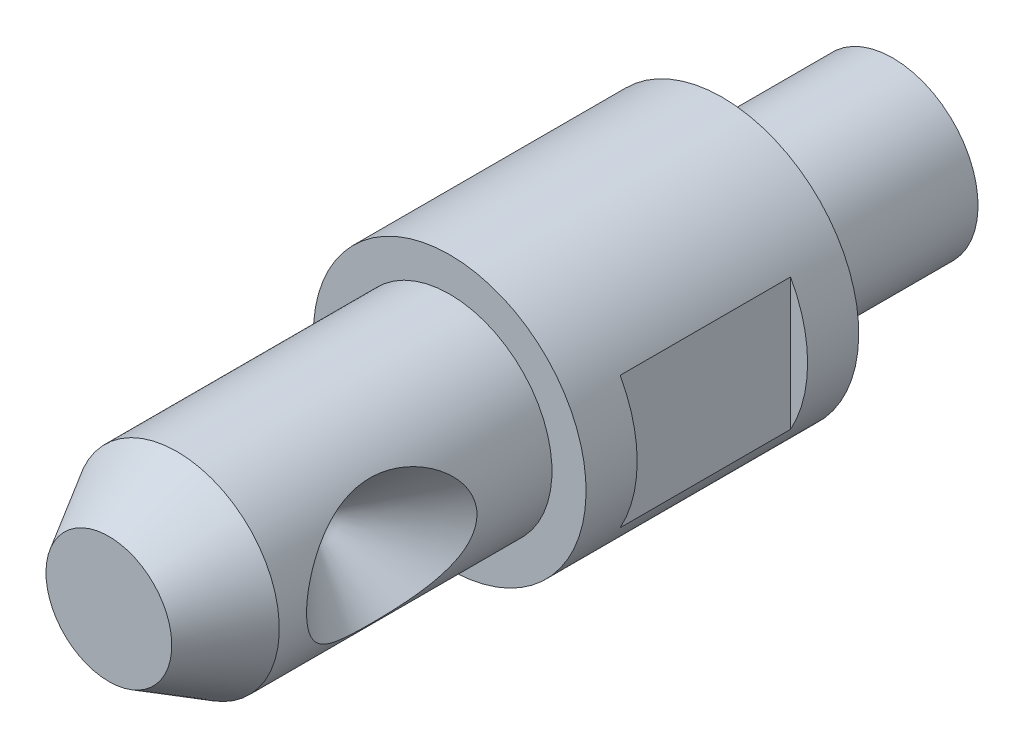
ISO-10303-21;
HEADER;
FILE_DESCRIPTION(('STEP AP214'),'2;1');
FILE_NAME('part.step','',(''),(''),'','','');
FILE_SCHEMA(('AUTOMOTIVE_DESIGN { 1 0 10303 214 1 1 1 1 }'));
ENDSEC;
DATA;
#1=APPLICATION_CONTEXT('core data for automotive mechanical design processes');
#2=APPLICATION_PROTOCOL_DEFINITION('international standard','automotive_design',2000,#1);
#3=PRODUCT_CONTEXT('',#1,'mechanical');
#4=PRODUCT('Part','Part','',(#3));
#5=PRODUCT_RELATED_PRODUCT_CATEGORY('part','',(#4));
#6=PRODUCT_DEFINITION_FORMATION('','',#4);
#7=PRODUCT_DEFINITION_CONTEXT('part definition',#1,'design');
#8=PRODUCT_DEFINITION('design','',#6,#7);
#9=PRODUCT_DEFINITION_SHAPE('','',#8);
#10=(LENGTH_UNIT() NAMED_UNIT(*) SI_UNIT(.MILLI.,.METRE.));
#11=(NAMED_UNIT(*) PLANE_ANGLE_UNIT() SI_UNIT($,.RADIAN.));
#12=(NAMED_UNIT(*) SI_UNIT($,.STERADIAN.) SOLID_ANGLE_UNIT());
#13=UNCERTAINTY_MEASURE_WITH_UNIT(LENGTH_MEASURE(1.E-05),#10,'distance_accuracy_value','');
#14=(GEOMETRIC_REPRESENTATION_CONTEXT(3) GLOBAL_UNCERTAINTY_ASSIGNED_CONTEXT((#13)) GLOBAL_UNIT_ASSIGNED_CONTEXT((#10,
#11,#12)) REPRESENTATION_CONTEXT('',''));
#15=CARTESIAN_POINT('',(0.,0.,0.));
#16=DIRECTION('',(0.,0.,1.));
#17=DIRECTION('',(1.,0.,0.));
#18=AXIS2_PLACEMENT_3D('',#15,#16,#17);
#19=CARTESIAN_POINT('',(0.,0.,0.));
#20=DIRECTION('',(0.,0.,-1.));
#21=DIRECTION('',(0.,1.,0.));
#22=AXIS2_PLACEMENT_3D('',#19,#20,#21);
#23=PLANE('',#22);
#24=CARTESIAN_POINT('',(0.,0.,0.));
#25=DIRECTION('',(0.,0.,-1.));
#26=DIRECTION('',(0.,1.,0.));
#27=AXIS2_PLACEMENT_3D('',#24,#25,#26);
#28=CIRCLE('',#27,4.);
#29=CARTESIAN_POINT('',(0.,4.,0.));
#30=VERTEX_POINT('',#29);
#31=EDGE_CURVE('E86',#30,#30,#28,.T.);
#32=ORIENTED_EDGE('',*,*,#31,.T.);
#33=EDGE_LOOP('',(#32));
#34=FACE_BOUND('',#33,.T.);
#35=CARTESIAN_POINT('',(0.,0.,0.));
#36=DIRECTION('',(0.,0.,-1.));
#37=DIRECTION('',(0.,1.,0.));
#38=AXIS2_PLACEMENT_3D('',#35,#36,#37);
#39=CIRCLE('',#38,2.5);
#40=CARTESIAN_POINT('',(0.,2.5,0.));
#41=VERTEX_POINT('',#40);
#42=EDGE_CURVE('E177',#41,#41,#39,.T.);
#43=ORIENTED_EDGE('',*,*,#42,.F.);
#44=EDGE_LOOP('',(#43));
#45=FACE_BOUND('',#44,.T.);
#46=ADVANCED_FACE('F14',(#34,#45),#23,.T.);
#47=CARTESIAN_POINT('',(0.,0.,8.));
#48=DIRECTION('',(0.,0.,-1.));
#49=DIRECTION('',(0.,1.,0.));
#50=AXIS2_PLACEMENT_3D('',#47,#48,#49);
#51=PLANE('',#50);
#52=CARTESIAN_POINT('',(0.,0.,8.));
#53=DIRECTION('',(0.,0.,-1.));
#54=DIRECTION('',(0.,1.,0.));
#55=AXIS2_PLACEMENT_3D('',#52,#53,#54);
#56=CIRCLE('',#55,4.);
#57=CARTESIAN_POINT('',(0.,4.,8.));
#58=VERTEX_POINT('',#57);
#59=EDGE_CURVE('E81',#58,#58,#56,.T.);
#60=ORIENTED_EDGE('',*,*,#59,.F.);
#61=EDGE_LOOP('',(#60));
#62=FACE_BOUND('',#61,.T.);
#63=CARTESIAN_POINT('',(0.,0.,8.));
#64=DIRECTION('',(0.,0.,-1.));
#65=DIRECTION('',(0.,1.,0.));
#66=AXIS2_PLACEMENT_3D('',#63,#64,#65);
#67=CIRCLE('',#66,3.);
#68=CARTESIAN_POINT('',(0.,3.,8.));
#69=VERTEX_POINT('',#68);
#70=EDGE_CURVE('E78',#69,#69,#67,.F.);
#71=ORIENTED_EDGE('',*,*,#70,.F.);
#72=EDGE_LOOP('',(#71));
#73=FACE_BOUND('',#72,.T.);
#74=ADVANCED_FACE('F121',(#62,#73),#51,.F.);
#75=CARTESIAN_POINT('',(0.,0.,8.));
#76=DIRECTION('',(0.,0.,-1.));
#77=DIRECTION('',(0.,1.,0.));
#78=AXIS2_PLACEMENT_3D('',#75,#76,#77);
#79=CYLINDRICAL_SURFACE('',#78,4.);
#80=DIRECTION('',(0.,0.,-1.));
#81=VECTOR('',#80,1.);
#82=CARTESIAN_POINT('',(-3.5,-1.93649167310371,8.));
#83=LINE('',#82,#81);
#84=CARTESIAN_POINT('',(-3.5,-1.93649167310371,1.5));
#85=VERTEX_POINT('',#84);
#86=CARTESIAN_POINT('',(-3.5,-1.93649167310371,6.5));
#87=VERTEX_POINT('',#86);
#88=EDGE_CURVE('E101',#85,#87,#83,.F.);
#89=ORIENTED_EDGE('',*,*,#88,.F.);
#90=CARTESIAN_POINT('',(0.,0.,1.5));
#91=DIRECTION('',(0.,0.,-1.));
#92=DIRECTION('',(0.,1.,0.));
#93=AXIS2_PLACEMENT_3D('',#90,#91,#92);
#94=CIRCLE('',#93,4.);
#95=CARTESIAN_POINT('',(-3.5,1.93649167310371,1.5));
#96=VERTEX_POINT('',#95);
#97=EDGE_CURVE('E97',#96,#85,#94,.F.);
#98=ORIENTED_EDGE('',*,*,#97,.F.);
#99=DIRECTION('',(0.,0.,-1.));
#100=VECTOR('',#99,1.);
#101=CARTESIAN_POINT('',(-3.5,1.93649167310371,8.));
#102=LINE('',#101,#100);
#103=CARTESIAN_POINT('',(-3.5,1.93649167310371,6.5));
#104=VERTEX_POINT('',#103);
#105=EDGE_CURVE('E95',#104,#96,#102,.T.);
#106=ORIENTED_EDGE('',*,*,#105,.F.);
#107=CARTESIAN_POINT('',(0.,0.,6.5));
#108=DIRECTION('',(0.,0.,1.));
#109=DIRECTION('',(0.,-1.,0.));
#110=AXIS2_PLACEMENT_3D('',#107,#108,#109);
#111=CIRCLE('',#110,4.);
#112=EDGE_CURVE('E99',#87,#104,#111,.F.);
#113=ORIENTED_EDGE('',*,*,#112,.F.);
#114=EDGE_LOOP('',(#89,#98,#106,#113));
#115=FACE_BOUND('',#114,.T.);
#116=CARTESIAN_POINT('',(0.,0.,6.5));
#117=DIRECTION('',(0.,0.,1.));
#118=DIRECTION('',(0.,-1.,0.));
#119=AXIS2_PLACEMENT_3D('',#116,#117,#118);
#120=CIRCLE('',#119,4.);
#121=CARTESIAN_POINT('',(3.5,1.93649167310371,6.5));
#122=VERTEX_POINT('',#121);
#123=CARTESIAN_POINT('',(3.5,-1.93649167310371,6.5));
#124=VERTEX_POINT('',#123);
#125=EDGE_CURVE('E42',#122,#124,#120,.F.);
#126=ORIENTED_EDGE('',*,*,#125,.F.);
#127=DIRECTION('',(0.,0.,-1.));
#128=VECTOR('',#127,1.);
#129=CARTESIAN_POINT('',(3.5,1.93649167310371,8.));
#130=LINE('',#129,#128);
#131=CARTESIAN_POINT('',(3.5,1.93649167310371,1.5));
#132=VERTEX_POINT('',#131);
#133=EDGE_CURVE('E92',#132,#122,#130,.F.);
#134=ORIENTED_EDGE('',*,*,#133,.F.);
#135=CARTESIAN_POINT('',(0.,0.,1.5));
#136=DIRECTION('',(0.,0.,-1.));
#137=DIRECTION('',(0.,1.,0.));
#138=AXIS2_PLACEMENT_3D('',#135,#136,#137);
#139=CIRCLE('',#138,4.);
#140=CARTESIAN_POINT('',(3.5,-1.93649167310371,1.5));
#141=VERTEX_POINT('',#140);
#142=EDGE_CURVE('E80',#141,#132,#139,.F.);
#143=ORIENTED_EDGE('',*,*,#142,.F.);
#144=DIRECTION('',(0.,0.,-1.));
#145=VECTOR('',#144,1.);
#146=CARTESIAN_POINT('',(3.5,-1.93649167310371,8.));
#147=LINE('',#146,#145);
#148=EDGE_CURVE('E83',#124,#141,#147,.T.);
#149=ORIENTED_EDGE('',*,*,#148,.F.);
#150=EDGE_LOOP('',(#126,#134,#143,#149));
#151=FACE_BOUND('',#150,.T.);
#152=ORIENTED_EDGE('',*,*,#59,.T.);
#153=EDGE_LOOP('',(#152));
#154=FACE_BOUND('',#153,.T.);
#155=ORIENTED_EDGE('',*,*,#31,.F.);
#156=EDGE_LOOP('',(#155));
#157=FACE_BOUND('',#156,.T.);
#158=ADVANCED_FACE('F16',(#115,#151,#154,#157),#79,.T.);
#159=CARTESIAN_POINT('',(0.,0.,18.));
#160=DIRECTION('',(0.,0.,-1.));
#161=DIRECTION('',(0.,1.,0.));
#162=AXIS2_PLACEMENT_3D('',#159,#160,#161);
#163=CYLINDRICAL_SURFACE('',#162,3.);
#164=CARTESIAN_POINT('',(2.5684274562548,-1.55021947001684,14.0693837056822));
#165=CARTESIAN_POINT('',(2.60656438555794,-1.4870429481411,14.1985150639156));
#166=CARTESIAN_POINT('',(2.64754676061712,-1.41393239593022,14.3221983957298));
#167=CARTESIAN_POINT('',(2.73033566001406,-1.24659023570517,14.5545060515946));
#168=CARTESIAN_POINT('',(2.77214261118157,-1.15234741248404,14.6631223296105));
#169=CARTESIAN_POINT('',(2.83541459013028,-0.98241896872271,14.8204120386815));
#170=CARTESIAN_POINT('',(2.85847720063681,-0.913726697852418,14.8759891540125));
#171=CARTESIAN_POINT('',(2.90101947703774,-0.767998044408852,14.9764944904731));
#172=CARTESIAN_POINT('',(2.92050669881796,-0.690979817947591,15.0214452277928));
#173=CARTESIAN_POINT('',(2.95126209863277,-0.542925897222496,15.0914970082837));
#174=CARTESIAN_POINT('',(2.96336012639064,-0.473047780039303,15.1186614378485));
#175=CARTESIAN_POINT('',(2.98275324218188,-0.32928371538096,15.1619432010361));
#176=CARTESIAN_POINT('',(2.99005127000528,-0.255400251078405,15.1780672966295));
#177=CARTESIAN_POINT('',(2.99909916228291,-0.105261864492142,15.1980300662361));
#178=CARTESIAN_POINT('',(3.00082243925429,-0.028997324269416,15.201809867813));
#179=CARTESIAN_POINT('',(2.99844123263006,0.122994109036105,15.1965700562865));
#180=CARTESIAN_POINT('',(2.99433660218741,0.198720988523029,15.1875501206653));
#181=CARTESIAN_POINT('',(2.98128436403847,0.341633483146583,15.1586455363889));
#182=CARTESIAN_POINT('',(2.9727219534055,0.40903430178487,15.1396239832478));
#183=CARTESIAN_POINT('',(2.95175694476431,0.539938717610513,15.0925538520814));
#184=CARTESIAN_POINT('',(2.93935283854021,0.603440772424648,15.0645017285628));
#185=CARTESIAN_POINT('',(2.90548428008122,0.75252017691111,14.986808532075));
#186=CARTESIAN_POINT('',(2.88242958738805,0.835611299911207,14.9330907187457));
#187=CARTESIAN_POINT('',(2.83263789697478,0.991409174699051,14.8136158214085));
#188=CARTESIAN_POINT('',(2.80589199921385,1.06408993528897,14.7478295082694));
#189=CARTESIAN_POINT('',(2.73997874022,1.22592162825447,14.5792762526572));
#190=CARTESIAN_POINT('',(2.70007796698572,1.31023808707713,14.4721663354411));
#191=CARTESIAN_POINT('',(2.62198217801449,1.46026291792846,14.2451410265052));
#192=CARTESIAN_POINT('',(2.58378932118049,1.52594826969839,14.1252100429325));
#193=CARTESIAN_POINT('',(2.51225270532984,1.64112582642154,13.872329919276));
#194=CARTESIAN_POINT('',(2.4790653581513,1.69013966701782,13.73911896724));
#195=CARTESIAN_POINT('',(2.42296229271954,1.76964715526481,13.4652355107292));
#196=CARTESIAN_POINT('',(2.40003761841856,1.8001569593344,13.3245696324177));
#197=CARTESIAN_POINT('',(2.37510046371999,1.83278098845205,13.1038337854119));
#198=CARTESIAN_POINT('',(2.3683190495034,1.84149785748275,13.025209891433));
#199=CARTESIAN_POINT('',(2.35912283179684,1.85326779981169,12.8672631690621));
#200=CARTESIAN_POINT('',(2.35670821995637,1.85632062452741,12.7879403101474));
#201=CARTESIAN_POINT('',(2.35638427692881,1.85673190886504,12.6292868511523));
#202=CARTESIAN_POINT('',(2.35847400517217,1.85409155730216,12.5499562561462));
#203=CARTESIAN_POINT('',(2.36703496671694,1.84314591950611,12.3919475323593));
#204=CARTESIAN_POINT('',(2.37350604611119,1.8348408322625,12.3132693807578));
#205=CARTESIAN_POINT('',(2.3978732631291,1.80303309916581,12.089895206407));
#206=CARTESIAN_POINT('',(2.42080912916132,1.77260240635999,11.9466592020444));
#207=CARTESIAN_POINT('',(2.47740352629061,1.69258339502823,11.6676897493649));
#208=CARTESIAN_POINT('',(2.5110828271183,1.6429579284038,11.5319714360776));
#209=CARTESIAN_POINT('',(2.58742688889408,1.52014611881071,11.2617560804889));
#210=CARTESIAN_POINT('',(2.63056121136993,1.44553171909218,11.1280366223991));
#211=CARTESIAN_POINT('',(2.71832385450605,1.27281863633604,10.8773539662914));
#212=CARTESIAN_POINT('',(2.76294727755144,1.17479145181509,10.7603414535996));
#213=CARTESIAN_POINT('',(2.8292958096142,0.999900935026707,10.5945154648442));
#214=CARTESIAN_POINT('',(2.85279282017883,0.931330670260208,10.5376454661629));
#215=CARTESIAN_POINT('',(2.89629824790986,0.785629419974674,10.4344979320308));
#216=CARTESIAN_POINT('',(2.91631224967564,0.708512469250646,10.3882034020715));
#217=CARTESIAN_POINT('',(2.94802133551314,0.560263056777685,10.3158220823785));
#218=CARTESIAN_POINT('',(2.9605522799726,0.490342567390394,10.2876377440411));
#219=CARTESIAN_POINT('',(2.98082772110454,0.346319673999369,10.2423281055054));
#220=CARTESIAN_POINT('',(2.98857564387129,0.27222030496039,10.2251948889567));
#221=CARTESIAN_POINT('',(2.99849792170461,0.121416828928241,10.203290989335));
#222=CARTESIAN_POINT('',(3.00064325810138,0.0447012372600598,10.1985846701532));
#223=CARTESIAN_POINT('',(2.99901903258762,-0.108359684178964,10.2021583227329));
#224=CARTESIAN_POINT('',(2.99524957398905,-0.184705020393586,10.2104380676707));
#225=CARTESIAN_POINT('',(2.9827720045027,-0.328415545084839,10.2380528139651));
#226=CARTESIAN_POINT('',(2.97448958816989,-0.39600665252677,10.2564359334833));
#227=CARTESIAN_POINT('',(2.95403322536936,-0.527366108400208,10.3023121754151));
#228=CARTESIAN_POINT('',(2.94185775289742,-0.59113294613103,10.3298088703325));
#229=CARTESIAN_POINT('',(2.90864345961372,-0.740163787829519,10.4058760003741));
#230=CARTESIAN_POINT('',(2.88603713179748,-0.823041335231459,10.458435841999));
#231=CARTESIAN_POINT('',(2.83708233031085,-0.97859785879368,10.5755644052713));
#232=CARTESIAN_POINT('',(2.81072496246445,-1.0512517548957,10.6401617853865));
#233=CARTESIAN_POINT('',(2.74559959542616,-1.21327814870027,10.8059343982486));
#234=CARTESIAN_POINT('',(2.70605167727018,-1.2978710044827,10.9114620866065));
#235=CARTESIAN_POINT('',(2.628408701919,-1.4486781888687,11.1353283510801));
#236=CARTESIAN_POINT('',(2.59031558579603,-1.51486865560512,11.25368328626));
#237=CARTESIAN_POINT('',(2.51861705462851,-1.63136880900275,11.5034906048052));
#238=CARTESIAN_POINT('',(2.48516451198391,-1.6811897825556,11.6352143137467));
#239=CARTESIAN_POINT('',(2.4281348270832,-1.76257117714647,11.9061780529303));
#240=CARTESIAN_POINT('',(2.40454776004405,-1.79414996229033,12.045410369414));
#241=CARTESIAN_POINT('',(2.37820232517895,-1.82876237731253,12.2647578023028));
#242=CARTESIAN_POINT('',(2.37084693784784,-1.83824640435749,12.3433681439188));
#243=CARTESIAN_POINT('',(2.36048321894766,-1.85153881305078,12.5013753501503));
#244=CARTESIAN_POINT('',(2.35747513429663,-1.85534687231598,12.5807722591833));
#245=CARTESIAN_POINT('',(2.35597466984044,-1.85725207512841,12.739738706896));
#246=CARTESIAN_POINT('',(2.35748577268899,-1.85534481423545,12.819308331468));
#247=CARTESIAN_POINT('',(2.36493971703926,-1.84583033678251,12.9778742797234));
#248=CARTESIAN_POINT('',(2.37088221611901,-1.83822356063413,13.0568706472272));
#249=CARTESIAN_POINT('',(2.39383688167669,-1.80836707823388,13.2812285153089));
#250=CARTESIAN_POINT('',(2.41597433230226,-1.77914960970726,13.4252019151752));
#251=CARTESIAN_POINT('',(2.47120627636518,-1.70157817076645,13.7053202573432));
#252=CARTESIAN_POINT('',(2.50427606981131,-1.65326729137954,13.8414820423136));
#253=CARTESIAN_POINT('',(2.54968478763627,-1.58094689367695,14.0049933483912));
#254=CARTESIAN_POINT('',(2.55896860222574,-1.56588873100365,14.0373560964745));
#255=CARTESIAN_POINT('',(2.5684274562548,-1.55021947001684,14.0693837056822));
#256=B_SPLINE_CURVE_WITH_KNOTS('',3,(#164,#165,#166,#167,#168,#169,#170,#171,#172,#173,#174,
#175,#176,#177,#178,#179,#180,#181,#182,#183,#184,#185,#186,#187,#188,#189,#190,#191,#192,#193,
#194,#195,#196,#197,#198,#199,#200,#201,#202,#203,#204,#205,#206,#207,#208,#209,#210,#211,#212,
#213,#214,#215,#216,#217,#218,#219,#220,#221,#222,#223,#224,#225,#226,#227,#228,#229,#230,#231,
#232,#233,#234,#235,#236,#237,#238,#239,#240,#241,#242,#243,#244,#245,#246,#247,#248,#249,#250,
#251,#252,#253,#254,#255),.UNSPECIFIED.,.T.,.F.,(4,2,2,2,2,2,2,2,2,2,2,2,2,2,2,2,2,2,2,2,2,2,2,
2,2,2,2,2,2,2,2,2,2,2,2,2,2,2,2,2,2,2,2,2,2,4),(0.,0.446102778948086,0.892442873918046,
1.16555515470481,1.43808344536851,1.66497963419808,1.89173672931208,2.1195737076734,
2.34741642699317,2.55821747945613,2.76910139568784,3.07218072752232,3.37600402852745,
3.79983883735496,4.22419506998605,4.65986396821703,5.09515192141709,5.3330585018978,
5.57097552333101,5.80884286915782,6.0467018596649,6.48927399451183,6.93270697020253,
7.40776873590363,7.88139788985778,8.15695770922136,8.43207154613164,8.66040711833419,
8.88857894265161,9.1179302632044,9.34727757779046,9.55800923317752,9.76882359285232,
10.0692654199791,10.3704318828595,10.7909112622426,11.2119333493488,11.6445752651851,
12.0767808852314,12.3150638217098,12.5533602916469,12.791840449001,13.0303021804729,
13.4739658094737,13.916633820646,14.0272777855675),.UNSPECIFIED.);
#257=CARTESIAN_POINT('',(2.5684274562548,-1.55021947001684,14.0693837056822));
#258=VERTEX_POINT('',#257);
#259=EDGE_CURVE('E9',#258,#258,#256,.T.);
#260=ORIENTED_EDGE('',*,*,#259,.T.);
#261=EDGE_LOOP('',(#260));
#262=FACE_BOUND('',#261,.T.);
#263=CARTESIAN_POINT('',(0.,0.,16.));
#264=DIRECTION('',(0.,0.,1.));
#265=DIRECTION('',(0.,-1.,0.));
#266=AXIS2_PLACEMENT_3D('',#263,#264,#265);
#267=CIRCLE('',#266,3.);
#268=CARTESIAN_POINT('',(0.,-3.,16.));
#269=VERTEX_POINT('',#268);
#270=EDGE_CURVE('E27',#269,#269,#267,.F.);
#271=ORIENTED_EDGE('',*,*,#270,.T.);
#272=EDGE_LOOP('',(#271));
#273=FACE_BOUND('',#272,.T.);
#274=ORIENTED_EDGE('',*,*,#70,.T.);
#275=EDGE_LOOP('',(#274));
#276=FACE_BOUND('',#275,.T.);
#277=ADVANCED_FACE('F69',(#262,#273,#276),#163,.T.);
#278=CARTESIAN_POINT('',(0.,0.,18.));
#279=DIRECTION('',(0.,0.,1.));
#280=DIRECTION('',(0.,-1.,0.));
#281=AXIS2_PLACEMENT_3D('',#278,#279,#280);
#282=PLANE('',#281);
#283=CARTESIAN_POINT('',(0.,0.,18.));
#284=DIRECTION('',(0.,0.,1.));
#285=DIRECTION('',(0.,-1.,0.));
#286=AXIS2_PLACEMENT_3D('',#283,#284,#285);
#287=CIRCLE('',#286,1.84529946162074);
#288=CARTESIAN_POINT('',(0.,-1.84529946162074,18.));
#289=VERTEX_POINT('',#288);
#290=EDGE_CURVE('E103',#289,#289,#287,.T.);
#291=ORIENTED_EDGE('',*,*,#290,.T.);
#292=EDGE_LOOP('',(#291));
#293=FACE_BOUND('',#292,.T.);
#294=ADVANCED_FACE('F72',(#293),#282,.T.);
#295=CARTESIAN_POINT('',(0.,0.,-5.));
#296=DIRECTION('',(0.,0.,1.));
#297=DIRECTION('',(0.,-1.,0.));
#298=AXIS2_PLACEMENT_3D('',#295,#296,#297);
#299=CYLINDRICAL_SURFACE('',#298,2.5);
#300=CARTESIAN_POINT('',(0.,0.,-5.));
#301=DIRECTION('',(0.,0.,-1.));
#302=DIRECTION('',(0.,1.,0.));
#303=AXIS2_PLACEMENT_3D('',#300,#301,#302);
#304=CIRCLE('',#303,2.5);
#305=CARTESIAN_POINT('',(0.,2.5,-5.));
#306=VERTEX_POINT('',#305);
#307=EDGE_CURVE('E182',#306,#306,#304,.T.);
#308=ORIENTED_EDGE('',*,*,#307,.F.);
#309=EDGE_LOOP('',(#308));
#310=FACE_BOUND('',#309,.T.);
#311=ORIENTED_EDGE('',*,*,#42,.T.);
#312=EDGE_LOOP('',(#311));
#313=FACE_BOUND('',#312,.T.);
#314=ADVANCED_FACE('F135',(#310,#313),#299,.T.);
#315=CARTESIAN_POINT('',(0.,0.,-5.));
#316=DIRECTION('',(0.,0.,-1.));
#317=DIRECTION('',(0.,1.,0.));
#318=AXIS2_PLACEMENT_3D('',#315,#316,#317);
#319=PLANE('',#318);
#320=ORIENTED_EDGE('',*,*,#307,.T.);
#321=EDGE_LOOP('',(#320));
#322=FACE_BOUND('',#321,.T.);
#323=ADVANCED_FACE('F138',(#322),#319,.T.);
#324=CARTESIAN_POINT('',(3.5,-13.,6.5));
#325=DIRECTION('',(0.,0.,1.));
#326=DIRECTION('',(0.,-1.,0.));
#327=AXIS2_PLACEMENT_3D('',#324,#325,#326);
#328=PLANE('',#327);
#329=DIRECTION('',(0.,1.,0.));
#330=VECTOR('',#329,1.);
#331=CARTESIAN_POINT('',(3.5,-13.,6.5));
#332=LINE('',#331,#330);
#333=EDGE_CURVE('E174',#124,#122,#332,.T.);
#334=ORIENTED_EDGE('',*,*,#333,.T.);
#335=ORIENTED_EDGE('',*,*,#125,.T.);
#336=EDGE_LOOP('',(#334,#335));
#337=FACE_BOUND('',#336,.T.);
#338=ADVANCED_FACE('F142',(#337),#328,.F.);
#339=CARTESIAN_POINT('',(3.5,-13.,1.5));
#340=DIRECTION('',(-1.,0.,0.));
#341=DIRECTION('',(0.,0.,1.));
#342=AXIS2_PLACEMENT_3D('',#339,#340,#341);
#343=PLANE('',#342);
#344=ORIENTED_EDGE('',*,*,#133,.T.);
#345=ORIENTED_EDGE('',*,*,#333,.F.);
#346=ORIENTED_EDGE('',*,*,#148,.T.);
#347=DIRECTION('',(0.,1.,0.));
#348=VECTOR('',#347,1.);
#349=CARTESIAN_POINT('',(3.5,-13.,1.5));
#350=LINE('',#349,#348);
#351=EDGE_CURVE('E170',#141,#132,#350,.T.);
#352=ORIENTED_EDGE('',*,*,#351,.T.);
#353=EDGE_LOOP('',(#344,#345,#346,#352));
#354=FACE_BOUND('',#353,.T.);
#355=ADVANCED_FACE('F148',(#354),#343,.F.);
#356=CARTESIAN_POINT('',(3.5,-13.,1.5));
#357=DIRECTION('',(0.,0.,-1.));
#358=DIRECTION('',(0.,1.,0.));
#359=AXIS2_PLACEMENT_3D('',#356,#357,#358);
#360=PLANE('',#359);
#361=ORIENTED_EDGE('',*,*,#351,.F.);
#362=ORIENTED_EDGE('',*,*,#142,.T.);
#363=EDGE_LOOP('',(#361,#362));
#364=FACE_BOUND('',#363,.T.);
#365=ADVANCED_FACE('F144',(#364),#360,.F.);
#366=CARTESIAN_POINT('',(-3.5,-13.,6.5));
#367=DIRECTION('',(0.,0.,1.));
#368=DIRECTION('',(0.,-1.,0.));
#369=AXIS2_PLACEMENT_3D('',#366,#367,#368);
#370=PLANE('',#369);
#371=DIRECTION('',(0.,1.,0.));
#372=VECTOR('',#371,1.);
#373=CARTESIAN_POINT('',(-3.5,-13.,6.5));
#374=LINE('',#373,#372);
#375=EDGE_CURVE('E34',#87,#104,#374,.T.);
#376=ORIENTED_EDGE('',*,*,#375,.F.);
#377=ORIENTED_EDGE('',*,*,#112,.T.);
#378=EDGE_LOOP('',(#376,#377));
#379=FACE_BOUND('',#378,.T.);
#380=ADVANCED_FACE('F147',(#379),#370,.F.);
#381=CARTESIAN_POINT('',(-3.5,-13.,1.5));
#382=DIRECTION('',(0.,0.,-1.));
#383=DIRECTION('',(0.,1.,0.));
#384=AXIS2_PLACEMENT_3D('',#381,#382,#383);
#385=PLANE('',#384);
#386=ORIENTED_EDGE('',*,*,#97,.T.);
#387=DIRECTION('',(0.,1.,0.));
#388=VECTOR('',#387,1.);
#389=CARTESIAN_POINT('',(-3.5,-13.,1.5));
#390=LINE('',#389,#388);
#391=EDGE_CURVE('E166',#85,#96,#390,.T.);
#392=ORIENTED_EDGE('',*,*,#391,.T.);
#393=EDGE_LOOP('',(#386,#392));
#394=FACE_BOUND('',#393,.T.);
#395=ADVANCED_FACE('F117',(#394),#385,.F.);
#396=CARTESIAN_POINT('',(-3.5,-13.,1.5));
#397=DIRECTION('',(1.,0.,0.));
#398=DIRECTION('',(0.,0.,-1.));
#399=AXIS2_PLACEMENT_3D('',#396,#397,#398);
#400=PLANE('',#399);
#401=ORIENTED_EDGE('',*,*,#88,.T.);
#402=ORIENTED_EDGE('',*,*,#375,.T.);
#403=ORIENTED_EDGE('',*,*,#105,.T.);
#404=ORIENTED_EDGE('',*,*,#391,.F.);
#405=EDGE_LOOP('',(#401,#402,#403,#404));
#406=FACE_BOUND('',#405,.T.);
#407=ADVANCED_FACE('F109',(#406),#400,.F.);
#408=CARTESIAN_POINT('',(0.,0.,18.));
#409=DIRECTION('',(0.,0.,-1.));
#410=DIRECTION('',(0.,1.,0.));
#411=AXIS2_PLACEMENT_3D('',#408,#409,#410);
#412=CONICAL_SURFACE('',#411,1.84529946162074,0.523598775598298);
#413=ORIENTED_EDGE('',*,*,#270,.F.);
#414=EDGE_LOOP('',(#413));
#415=FACE_BOUND('',#414,.T.);
#416=ORIENTED_EDGE('',*,*,#290,.F.);
#417=EDGE_LOOP('',(#416));
#418=FACE_BOUND('',#417,.T.);
#419=ADVANCED_FACE('F66',(#415,#418),#412,.T.);
#420=CARTESIAN_POINT('',(0.499999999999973,0.,12.7));
#421=DIRECTION('',(1.,0.,0.));
#422=DIRECTION('',(0.,0.,-1.));
#423=AXIS2_PLACEMENT_3D('',#420,#421,#422);
#424=CONICAL_SURFACE('',#423,0.,0.785398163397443);
#425=CARTESIAN_POINT('',(0.499999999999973,0.,12.7));
#426=VERTEX_POINT('',#425);
#427=VERTEX_LOOP('',#426);
#428=FACE_BOUND('',#427,.T.);
#429=ORIENTED_EDGE('',*,*,#259,.F.);
#430=EDGE_LOOP('',(#429));
#431=FACE_BOUND('',#430,.T.);
#432=ADVANCED_FACE('F63',(#428,#431),#424,.F.);
#433=CLOSED_SHELL('',(#46,#74,#158,#277,#294,#314,#323,#338,#355,#365,#380,#395,#407,#419,#432));
#434=MANIFOLD_SOLID_BREP('B1',#433);
#435=ADVANCED_BREP_SHAPE_REPRESENTATION('',(#18,#434),#14);
#436=SHAPE_DEFINITION_REPRESENTATION(#9,#435);
ENDSEC;
END-ISO-10303-21;
